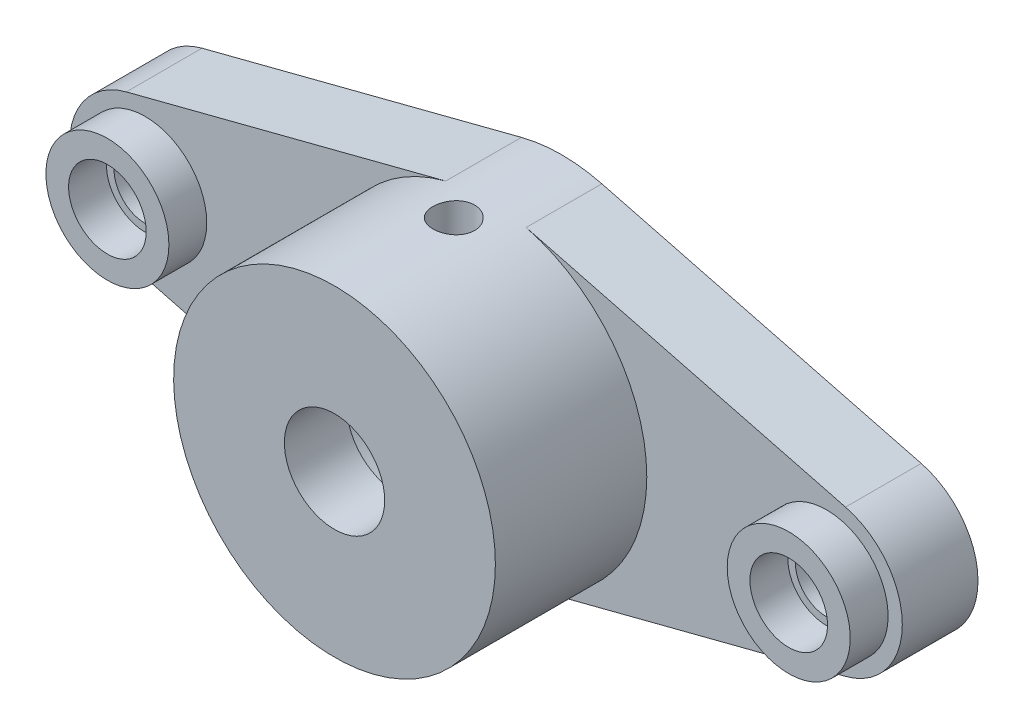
from build123d import *

# Parameters (mm, degrees)
SKETCH_1_R          = 5.25
SKETCH_1_R_2        = 1
EXTRUDE_1_DEPTH     = 4
HOLE_WIZARD_M4_1_D  = 3.3
SKETCH_6_R          = 8.5
SKETCH_6_R_2        = 5.25
EXTRUDE_2_DEPTH     = 8
EXTRUDE_START       = -3.3
SKETCH_7_R          = 5.25
SKETCH_7_R_2        = 2.65
EXTRUDE_3_DEPTH     = 3.3
SKETCH_8_R          = 1.1
CUT_EXTRUDE_1_DEPTH = 14.65
SKETCH_9_R          = 3.25
SKETCH_9_R_2        = 2.05
EXTRUDE_4_DEPTH     = 2


with BuildPart() as part:
    # Sketch 1 → Extrude 1 (new body)
    with BuildSketch(Plane.XY):
        with BuildLine():
            Line((-19, 3.872983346), (-2.125, 8.230089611))
            ThreePointArc((-2.125, 8.230089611), (0, 8.5), (2.125, 8.230089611))
            Line((2.125, 8.230089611), (19, 3.872983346))
            ThreePointArc((19, 3.872983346), (22, 0), (19, -3.872983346))
            Line((19, -3.872983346), (2.125, -8.230089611))
            ThreePointArc((2.125, -8.230089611), (0, -8.5), (-2.125, -8.230089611))
            Line((-2.125, -8.230089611), (-19, -3.872983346))
            ThreePointArc((-19, -3.872983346), (-22, 0), (-19, 3.872983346))
        make_face()
        Circle(SKETCH_1_R, mode=Mode.SUBTRACT)
        with Locations((-18, 0)):
            Circle(SKETCH_1_R_2, mode=Mode.SUBTRACT)
        with Locations(Location((18, 0, 0), (0, 0, 180))):
            Circle(SKETCH_1_R_2, mode=Mode.SUBTRACT)
    extrude(amount=EXTRUDE_1_DEPTH)

    # Hole Wizard M4 _1 (through all)
    with Locations(Plane(origin=(-18, 0, 4), x_dir=(1, 0, 0), z_dir=(0, 0, 1))):
        with Locations((0, 0), (36, 0)):
            Hole(HOLE_WIZARD_M4_1_D / 2)

    # Sketch 6 → Extrude 2 (add)
    with BuildSketch(Plane.XY.offset(4)):
        with Locations(Location((0, 0, 0), (0, 0, 104.477512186))):
            Circle(SKETCH_6_R)
        Circle(SKETCH_6_R_2, mode=Mode.SUBTRACT)
    extrude(amount=EXTRUDE_2_DEPTH)

    # Sketch 7 → Extrude 3 (add)
    with BuildSketch(Plane.XY.offset(12).offset(EXTRUDE_START)):
        Circle(SKETCH_7_R)
        Circle(SKETCH_7_R_2, mode=Mode.SUBTRACT)
    extrude(amount=EXTRUDE_3_DEPTH)

    # Sketch 8 → Cut-Extrude 1 (cut, symmetric)
    with BuildSketch(Plane(origin=(0, 0, 0), x_dir=(1, 0, 0), z_dir=(0, 1, 0))):
        with Locations(Location((0, -5.7, 0), (0, 0, 270))):
            Circle(SKETCH_8_R)
    extrude(amount=CUT_EXTRUDE_1_DEPTH, both=True, mode=Mode.SUBTRACT)

    # Sketch 9 → Extrude 4 (add)
    # profile 1 of 2: a face of its own
    with BuildSketch(Plane.XY.offset(4)):
        with Locations((-18, 0)):
            Circle(SKETCH_9_R)
        with Locations((-18, 0)):
            Circle(SKETCH_9_R_2, mode=Mode.SUBTRACT)
    # profile 2 of 2: a face of its own
    with BuildSketch(Plane.XY.offset(4)):
        with Locations(Location((18, 0, 0), (0, 0, 180))):
            Circle(SKETCH_9_R)
        with Locations(Location((18, 0, 0), (0, 0, 180))):
            Circle(SKETCH_9_R_2, mode=Mode.SUBTRACT)
    extrude(amount=EXTRUDE_4_DEPTH)


solid = part.part
